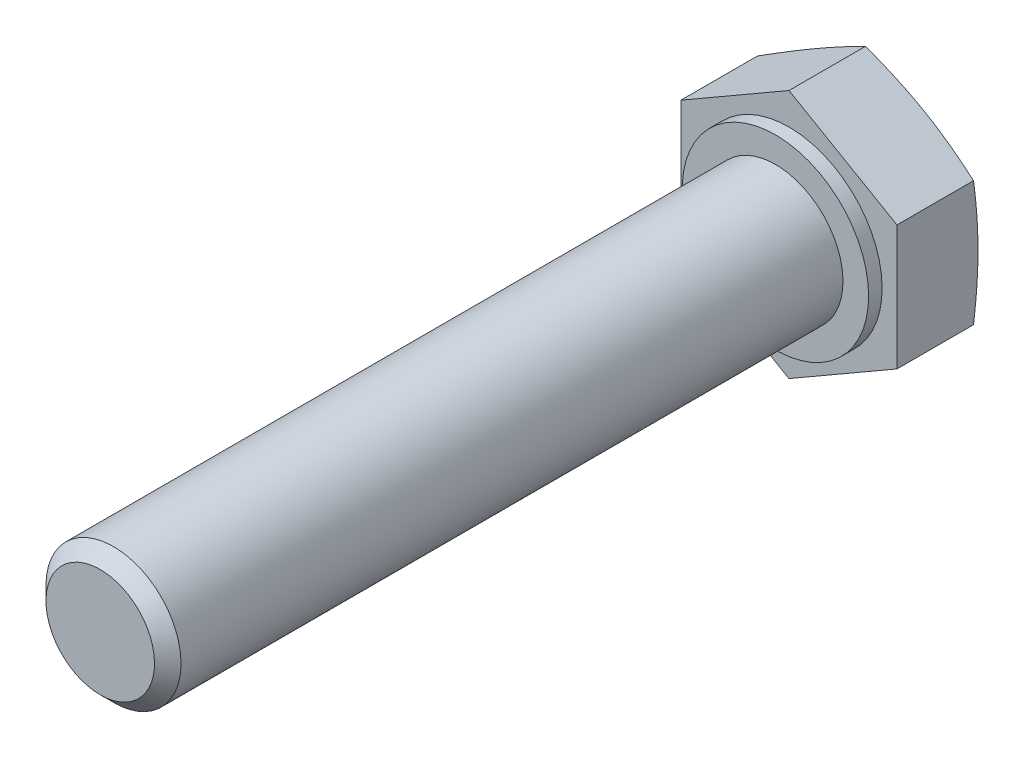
ISO-10303-21;
HEADER;
FILE_DESCRIPTION(('STEP AP214'),'2;1');
FILE_NAME('part.step','',(''),(''),'','','');
FILE_SCHEMA(('AUTOMOTIVE_DESIGN { 1 0 10303 214 1 1 1 1 }'));
ENDSEC;
DATA;
#1=APPLICATION_CONTEXT('core data for automotive mechanical design processes');
#2=APPLICATION_PROTOCOL_DEFINITION('international standard','automotive_design',2000,#1);
#3=PRODUCT_CONTEXT('',#1,'mechanical');
#4=PRODUCT('Part','Part','',(#3));
#5=PRODUCT_RELATED_PRODUCT_CATEGORY('part','',(#4));
#6=PRODUCT_DEFINITION_FORMATION('','',#4);
#7=PRODUCT_DEFINITION_CONTEXT('part definition',#1,'design');
#8=PRODUCT_DEFINITION('design','',#6,#7);
#9=PRODUCT_DEFINITION_SHAPE('','',#8);
#10=(LENGTH_UNIT() NAMED_UNIT(*) SI_UNIT(.MILLI.,.METRE.));
#11=(NAMED_UNIT(*) PLANE_ANGLE_UNIT() SI_UNIT($,.RADIAN.));
#12=(NAMED_UNIT(*) SI_UNIT($,.STERADIAN.) SOLID_ANGLE_UNIT());
#13=UNCERTAINTY_MEASURE_WITH_UNIT(LENGTH_MEASURE(1.E-05),#10,'distance_accuracy_value','');
#14=(GEOMETRIC_REPRESENTATION_CONTEXT(3) GLOBAL_UNCERTAINTY_ASSIGNED_CONTEXT((#13)) GLOBAL_UNIT_ASSIGNED_CONTEXT((#10,
#11,#12)) REPRESENTATION_CONTEXT('',''));
#15=CARTESIAN_POINT('',(0.,0.,0.));
#16=DIRECTION('',(0.,0.,1.));
#17=DIRECTION('',(1.,0.,0.));
#18=AXIS2_PLACEMENT_3D('',#15,#16,#17);
#19=CARTESIAN_POINT('',(6.92820323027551,-4.,3.));
#20=DIRECTION('',(0.,0.,1.));
#21=DIRECTION('',(0.866025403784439,-0.5,0.));
#22=AXIS2_PLACEMENT_3D('',#19,#20,#21);
#23=PLANE('',#22);
#24=CARTESIAN_POINT('',(0.,0.,3.));
#25=DIRECTION('',(0.,0.,-1.));
#26=DIRECTION('',(-0.866025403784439,0.5,0.));
#27=AXIS2_PLACEMENT_3D('',#24,#25,#26);
#28=CIRCLE('',#27,3.45);
#29=CARTESIAN_POINT('',(-2.98778764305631,1.725,3.));
#30=VERTEX_POINT('',#29);
#31=EDGE_CURVE('E159',#30,#30,#28,.T.);
#32=ORIENTED_EDGE('',*,*,#31,.T.);
#33=EDGE_LOOP('',(#32));
#34=FACE_BOUND('',#33,.T.);
#35=DIRECTION('',(-0.866025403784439,0.5,0.));
#36=VECTOR('',#35,1.);
#37=CARTESIAN_POINT('',(8.92820323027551,-0.535898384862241,3.));
#38=LINE('',#37,#36);
#39=CARTESIAN_POINT('',(4.,2.30940107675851,3.));
#40=VERTEX_POINT('',#39);
#41=CARTESIAN_POINT('',(0.,4.61880215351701,3.));
#42=VERTEX_POINT('',#41);
#43=EDGE_CURVE('E161',#40,#42,#38,.T.);
#44=ORIENTED_EDGE('',*,*,#43,.T.);
#45=DIRECTION('',(-0.866025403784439,-0.5,0.));
#46=VECTOR('',#45,1.);
#47=CARTESIAN_POINT('',(1.46410161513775,5.46410161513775,3.));
#48=LINE('',#47,#46);
#49=CARTESIAN_POINT('',(-4.,2.3094010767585,3.));
#50=VERTEX_POINT('',#49);
#51=EDGE_CURVE('E9',#42,#50,#48,.T.);
#52=ORIENTED_EDGE('',*,*,#51,.T.);
#53=DIRECTION('',(0.,-1.,0.));
#54=VECTOR('',#53,1.);
#55=CARTESIAN_POINT('',(-4.,-4.,3.));
#56=LINE('',#55,#54);
#57=CARTESIAN_POINT('',(-4.,-2.30940107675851,3.));
#58=VERTEX_POINT('',#57);
#59=EDGE_CURVE('E22',#50,#58,#56,.T.);
#60=ORIENTED_EDGE('',*,*,#59,.T.);
#61=DIRECTION('',(0.866025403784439,-0.5,0.));
#62=VECTOR('',#61,1.);
#63=CARTESIAN_POINT('',(4.92820323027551,-7.46410161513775,3.));
#64=LINE('',#63,#62);
#65=CARTESIAN_POINT('',(0.,-4.61880215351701,3.));
#66=VERTEX_POINT('',#65);
#67=EDGE_CURVE('E174',#58,#66,#64,.T.);
#68=ORIENTED_EDGE('',*,*,#67,.T.);
#69=DIRECTION('',(0.866025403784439,0.5,0.));
#70=VECTOR('',#69,1.);
#71=CARTESIAN_POINT('',(5.46410161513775,-1.46410161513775,3.));
#72=LINE('',#71,#70);
#73=CARTESIAN_POINT('',(4.,-2.3094010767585,3.));
#74=VERTEX_POINT('',#73);
#75=EDGE_CURVE('E166',#66,#74,#72,.T.);
#76=ORIENTED_EDGE('',*,*,#75,.T.);
#77=DIRECTION('',(0.,1.,0.));
#78=VECTOR('',#77,1.);
#79=CARTESIAN_POINT('',(4.,-4.,3.));
#80=LINE('',#79,#78);
#81=EDGE_CURVE('E164',#74,#40,#80,.T.);
#82=ORIENTED_EDGE('',*,*,#81,.T.);
#83=EDGE_LOOP('',(#44,#52,#60,#68,#76,#82));
#84=FACE_BOUND('',#83,.T.);
#85=ADVANCED_FACE('F14',(#34,#84),#23,.T.);
#86=CARTESIAN_POINT('',(0.,0.,28.5));
#87=DIRECTION('',(0.,0.,-1.));
#88=DIRECTION('',(-0.866025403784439,0.5,0.));
#89=AXIS2_PLACEMENT_3D('',#86,#87,#88);
#90=CYLINDRICAL_SURFACE('',#89,3.45);
#91=CARTESIAN_POINT('',(0.,0.,3.5));
#92=DIRECTION('',(0.,0.,-1.));
#93=DIRECTION('',(-0.866025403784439,0.5,0.));
#94=AXIS2_PLACEMENT_3D('',#91,#92,#93);
#95=CIRCLE('',#94,3.45);
#96=CARTESIAN_POINT('',(-2.98778764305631,1.725,3.5));
#97=VERTEX_POINT('',#96);
#98=EDGE_CURVE('E252',#97,#97,#95,.T.);
#99=ORIENTED_EDGE('',*,*,#98,.T.);
#100=EDGE_LOOP('',(#99));
#101=FACE_BOUND('',#100,.T.);
#102=ORIENTED_EDGE('',*,*,#31,.F.);
#103=EDGE_LOOP('',(#102));
#104=FACE_BOUND('',#103,.T.);
#105=ADVANCED_FACE('F147',(#101,#104),#90,.T.);
#106=CARTESIAN_POINT('',(2.98778764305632,-1.725,3.5));
#107=DIRECTION('',(0.,0.,1.));
#108=DIRECTION('',(0.866025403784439,-0.5,0.));
#109=AXIS2_PLACEMENT_3D('',#106,#107,#108);
#110=PLANE('',#109);
#111=CARTESIAN_POINT('',(0.,0.,3.5));
#112=DIRECTION('',(0.,0.,-1.));
#113=DIRECTION('',(-0.866025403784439,0.5,0.));
#114=AXIS2_PLACEMENT_3D('',#111,#112,#113);
#115=CIRCLE('',#114,2.5);
#116=CARTESIAN_POINT('',(-2.1650635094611,1.25,3.5));
#117=VERTEX_POINT('',#116);
#118=EDGE_CURVE('E254',#117,#117,#115,.T.);
#119=ORIENTED_EDGE('',*,*,#118,.T.);
#120=EDGE_LOOP('',(#119));
#121=FACE_BOUND('',#120,.T.);
#122=ORIENTED_EDGE('',*,*,#98,.F.);
#123=EDGE_LOOP('',(#122));
#124=FACE_BOUND('',#123,.T.);
#125=ADVANCED_FACE('F143',(#121,#124),#110,.T.);
#126=CARTESIAN_POINT('',(0.,0.,28.5));
#127=DIRECTION('',(0.,0.,-1.));
#128=DIRECTION('',(-0.866025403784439,0.5,0.));
#129=AXIS2_PLACEMENT_3D('',#126,#127,#128);
#130=CYLINDRICAL_SURFACE('',#129,2.5);
#131=CARTESIAN_POINT('',(0.,0.,28.0095));
#132=DIRECTION('',(0.,0.,-1.));
#133=DIRECTION('',(-0.866025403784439,0.5,0.));
#134=AXIS2_PLACEMENT_3D('',#131,#132,#133);
#135=CIRCLE('',#134,2.5);
#136=CARTESIAN_POINT('',(-2.1650635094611,1.25,28.0095));
#137=VERTEX_POINT('',#136);
#138=EDGE_CURVE('E258',#137,#137,#135,.T.);
#139=ORIENTED_EDGE('',*,*,#138,.T.);
#140=EDGE_LOOP('',(#139));
#141=FACE_BOUND('',#140,.T.);
#142=ORIENTED_EDGE('',*,*,#118,.F.);
#143=EDGE_LOOP('',(#142));
#144=FACE_BOUND('',#143,.T.);
#145=ADVANCED_FACE('F139',(#141,#144),#130,.T.);
#146=CARTESIAN_POINT('',(0.,0.,28.0095));
#147=DIRECTION('',(0.,0.,-1.));
#148=DIRECTION('',(-0.866025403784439,0.5,0.));
#149=AXIS2_PLACEMENT_3D('',#146,#147,#148);
#150=CONICAL_SURFACE('',#149,2.5,0.785398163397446);
#151=CARTESIAN_POINT('',(0.,0.,28.5));
#152=DIRECTION('',(0.,0.,-1.));
#153=DIRECTION('',(-0.866025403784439,0.5,0.));
#154=AXIS2_PLACEMENT_3D('',#151,#152,#153);
#155=CIRCLE('',#154,2.0095);
#156=CARTESIAN_POINT('',(-1.74027804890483,1.00475,28.5));
#157=VERTEX_POINT('',#156);
#158=EDGE_CURVE('E105',#157,#157,#155,.T.);
#159=ORIENTED_EDGE('',*,*,#158,.T.);
#160=EDGE_LOOP('',(#159));
#161=FACE_BOUND('',#160,.T.);
#162=ORIENTED_EDGE('',*,*,#138,.F.);
#163=EDGE_LOOP('',(#162));
#164=FACE_BOUND('',#163,.T.);
#165=ADVANCED_FACE('F135',(#161,#164),#150,.T.);
#166=CARTESIAN_POINT('',(1.74027804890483,-1.00475,28.5));
#167=DIRECTION('',(0.,0.,1.));
#168=DIRECTION('',(0.866025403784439,-0.5,0.));
#169=AXIS2_PLACEMENT_3D('',#166,#167,#168);
#170=PLANE('',#169);
#171=ORIENTED_EDGE('',*,*,#158,.F.);
#172=EDGE_LOOP('',(#171));
#173=FACE_BOUND('',#172,.T.);
#174=ADVANCED_FACE('F130',(#173),#170,.T.);
#175=CARTESIAN_POINT('',(0.,4.61880215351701,0.));
#176=DIRECTION('',(-0.5,0.866025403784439,0.));
#177=DIRECTION('',(-0.866025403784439,-0.5,0.));
#178=AXIS2_PLACEMENT_3D('',#175,#176,#177);
#179=PLANE('',#178);
#180=DIRECTION('',(0.,0.,1.));
#181=VECTOR('',#180,1.);
#182=CARTESIAN_POINT('',(-4.,2.3094010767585,0.));
#183=LINE('',#182,#181);
#184=CARTESIAN_POINT('',(-4.,2.3094010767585,0.16580753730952));
#185=VERTEX_POINT('',#184);
#186=EDGE_CURVE('E179',#185,#50,#183,.T.);
#187=ORIENTED_EDGE('',*,*,#186,.T.);
#188=ORIENTED_EDGE('',*,*,#51,.F.);
#189=DIRECTION('',(0.,0.,1.));
#190=VECTOR('',#189,1.);
#191=CARTESIAN_POINT('',(0.,4.61880215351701,0.));
#192=LINE('',#191,#190);
#193=CARTESIAN_POINT('',(0.,4.61880215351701,0.16580753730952));
#194=VERTEX_POINT('',#193);
#195=EDGE_CURVE('E35',#194,#42,#192,.T.);
#196=ORIENTED_EDGE('',*,*,#195,.F.);
#197=CARTESIAN_POINT('',(-4.0002,2.30928560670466,0.16583847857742));
#198=CARTESIAN_POINT('',(-3.83407348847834,2.40519879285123,0.140126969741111));
#199=CARTESIAN_POINT('',(-3.66764575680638,2.50128588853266,0.116785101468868));
#200=CARTESIAN_POINT('',(-3.33420250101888,2.69379944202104,0.0757755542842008));
#201=CARTESIAN_POINT('',(-3.16718676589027,2.79022602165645,0.0581101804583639));
#202=CARTESIAN_POINT('',(-2.83358019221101,2.98283386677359,0.0294849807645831));
#203=CARTESIAN_POINT('',(-2.66699160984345,3.07901382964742,0.0184910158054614));
#204=CARTESIAN_POINT('',(-2.3336019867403,3.27149641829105,0.00374922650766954));
#205=CARTESIAN_POINT('',(-2.16680099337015,3.36779901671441,0.));
#206=CARTESIAN_POINT('',(-1.83319900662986,3.56040421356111,0.));
#207=CARTESIAN_POINT('',(-1.66639801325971,3.65670681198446,0.00374922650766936));
#208=CARTESIAN_POINT('',(-1.33300839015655,3.84918940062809,0.0184910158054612));
#209=CARTESIAN_POINT('',(-1.16641980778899,3.94536936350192,0.029484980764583));
#210=CARTESIAN_POINT('',(-0.832813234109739,4.13797720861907,0.0581101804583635));
#211=CARTESIAN_POINT('',(-0.665797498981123,4.23440378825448,0.0757755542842));
#212=CARTESIAN_POINT('',(-0.332354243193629,4.42691734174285,0.116785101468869));
#213=CARTESIAN_POINT('',(-0.165926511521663,4.52300443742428,0.140126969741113));
#214=CARTESIAN_POINT('',(0.000200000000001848,4.61891762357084,0.165838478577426));
#215=B_SPLINE_CURVE_WITH_KNOTS('',3,(#197,#198,#199,#200,#201,#202,#203,#204,#205,#206,#207,
#208,#209,#210,#211,#212,#213,#214),.UNSPECIFIED.,.F.,.F.,(4,2,2,2,2,2,2,2,4),(0.,
0.580655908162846,1.1615473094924,1.73944052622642,2.31722188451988,2.89500324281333,
3.47289645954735,4.05378786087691,4.63444376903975),.UNSPECIFIED.);
#216=CARTESIAN_POINT('',(-2.,3.46410161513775,0.));
#217=VERTEX_POINT('',#216);
#218=EDGE_CURVE('E95',#217,#194,#215,.T.);
#219=ORIENTED_EDGE('',*,*,#218,.F.);
#220=EDGE_CURVE('E102',#185,#217,#215,.T.);
#221=ORIENTED_EDGE('',*,*,#220,.F.);
#222=EDGE_LOOP('',(#187,#188,#196,#219,#221));
#223=FACE_BOUND('',#222,.T.);
#224=ADVANCED_FACE('F94',(#223),#179,.T.);
#225=CARTESIAN_POINT('',(-4.,2.3094010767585,0.));
#226=DIRECTION('',(-1.,0.,0.));
#227=DIRECTION('',(0.,-1.,0.));
#228=AXIS2_PLACEMENT_3D('',#225,#226,#227);
#229=PLANE('',#228);
#230=DIRECTION('',(0.,0.,1.));
#231=VECTOR('',#230,1.);
#232=CARTESIAN_POINT('',(-4.,-2.30940107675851,0.));
#233=LINE('',#232,#231);
#234=CARTESIAN_POINT('',(-4.,-2.30940107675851,0.165807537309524));
#235=VERTEX_POINT('',#234);
#236=EDGE_CURVE('E182',#235,#58,#233,.T.);
#237=ORIENTED_EDGE('',*,*,#236,.T.);
#238=ORIENTED_EDGE('',*,*,#59,.F.);
#239=ORIENTED_EDGE('',*,*,#186,.F.);
#240=CARTESIAN_POINT('',(-4.,-2.30963201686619,0.165838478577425));
#241=CARTESIAN_POINT('',(-4.,-2.11780564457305,0.140126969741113));
#242=CARTESIAN_POINT('',(-4.,-1.9256314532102,0.116785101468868));
#243=CARTESIAN_POINT('',(-4.,-1.54060434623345,0.0757755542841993));
#244=CARTESIAN_POINT('',(-4.,-1.34775118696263,0.0581101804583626));
#245=CARTESIAN_POINT('',(-4.,-0.962535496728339,0.0294849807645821));
#246=CARTESIAN_POINT('',(-4.,-0.770175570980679,0.0184910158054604));
#247=CARTESIAN_POINT('',(-4.,-0.38521039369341,0.00374922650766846));
#248=CARTESIAN_POINT('',(-4.,-0.192605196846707,0.));
#249=CARTESIAN_POINT('',(-4.,0.192605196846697,0.));
#250=CARTESIAN_POINT('',(-4.,0.385210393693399,0.0037492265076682));
#251=CARTESIAN_POINT('',(-4.,0.770175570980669,0.0184910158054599));
#252=CARTESIAN_POINT('',(-4.,0.962535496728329,0.0294849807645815));
#253=CARTESIAN_POINT('',(-4.,1.34775118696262,0.0581101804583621));
#254=CARTESIAN_POINT('',(-4.,1.54060434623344,0.075775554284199));
#255=CARTESIAN_POINT('',(-4.,1.92563145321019,0.116785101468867));
#256=CARTESIAN_POINT('',(-4.,2.11780564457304,0.14012696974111));
#257=CARTESIAN_POINT('',(-4.,2.30963201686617,0.16583847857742));
#258=B_SPLINE_CURVE_WITH_KNOTS('',3,(#240,#241,#242,#243,#244,#245,#246,#247,#248,#249,#250,
#251,#252,#253,#254,#255,#256,#257),.UNSPECIFIED.,.F.,.F.,(4,2,2,2,2,2,2,2,4),(0.,
0.580655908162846,1.1615473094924,1.73944052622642,2.31722188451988,2.89500324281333,
3.47289645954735,4.05378786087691,4.63444376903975),.UNSPECIFIED.);
#259=CARTESIAN_POINT('',(-4.,0.,0.));
#260=VERTEX_POINT('',#259);
#261=EDGE_CURVE('E107',#260,#185,#258,.T.);
#262=ORIENTED_EDGE('',*,*,#261,.F.);
#263=EDGE_CURVE('E103',#235,#260,#258,.T.);
#264=ORIENTED_EDGE('',*,*,#263,.F.);
#265=EDGE_LOOP('',(#237,#238,#239,#262,#264));
#266=FACE_BOUND('',#265,.T.);
#267=ADVANCED_FACE('F129',(#266),#229,.T.);
#268=CARTESIAN_POINT('',(-4.,-2.30940107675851,0.));
#269=DIRECTION('',(-0.5,-0.866025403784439,0.));
#270=DIRECTION('',(0.866025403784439,-0.5,0.));
#271=AXIS2_PLACEMENT_3D('',#268,#269,#270);
#272=PLANE('',#271);
#273=DIRECTION('',(0.,0.,1.));
#274=VECTOR('',#273,1.);
#275=CARTESIAN_POINT('',(0.,-4.61880215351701,0.));
#276=LINE('',#275,#274);
#277=CARTESIAN_POINT('',(0.,-4.61880215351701,0.165807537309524));
#278=VERTEX_POINT('',#277);
#279=EDGE_CURVE('E184',#278,#66,#276,.T.);
#280=ORIENTED_EDGE('',*,*,#279,.T.);
#281=ORIENTED_EDGE('',*,*,#67,.F.);
#282=ORIENTED_EDGE('',*,*,#236,.F.);
#283=CARTESIAN_POINT('',(-7.34441323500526,-0.378503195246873,0.89874448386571));
#284=CARTESIAN_POINT('',(-7.18662398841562,-0.469602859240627,0.857788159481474));
#285=CARTESIAN_POINT('',(-7.02873757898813,-0.560758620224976,0.8173225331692));
#286=CARTESIAN_POINT('',(-6.71272243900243,-0.743210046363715,0.737637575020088));
#287=CARTESIAN_POINT('',(-6.55459369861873,-0.834505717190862,0.698418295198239));
#288=CARTESIAN_POINT('',(-6.23791240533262,-1.01734174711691,0.621458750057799));
#289=CARTESIAN_POINT('',(-6.07935959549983,-1.10888225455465,0.583719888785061));
#290=CARTESIAN_POINT('',(-5.7619283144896,-1.29215129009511,0.510118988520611));
#291=CARTESIAN_POINT('',(-5.60304984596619,-1.38387981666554,0.474256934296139));
#292=CARTESIAN_POINT('',(-5.28619796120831,-1.56681433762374,0.405137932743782));
#293=CARTESIAN_POINT('',(-5.12822764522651,-1.6580185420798,0.371862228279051));
#294=CARTESIAN_POINT('',(-4.81185902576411,-1.84067404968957,0.308151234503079));
#295=CARTESIAN_POINT('',(-4.65346071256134,-1.93212535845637,0.27771601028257));
#296=CARTESIAN_POINT('',(-4.17756469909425,-2.20688404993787,0.191656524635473));
#297=CARTESIAN_POINT('',(-3.85930938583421,-2.39062884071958,0.141265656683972));
#298=CARTESIAN_POINT('',(-3.37862783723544,-2.66815046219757,0.0808604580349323));
#299=CARTESIAN_POINT('',(-3.21692072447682,-2.76151210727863,0.0631992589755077));
#300=CARTESIAN_POINT('',(-2.8930859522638,-2.94847820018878,0.0340086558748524));
#301=CARTESIAN_POINT('',(-2.73095830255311,-3.04208264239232,0.0224791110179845));
#302=CARTESIAN_POINT('',(-2.40652343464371,-3.22939520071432,0.00621961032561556));
#303=CARTESIAN_POINT('',(-2.24421634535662,-3.32310324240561,0.00148628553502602));
#304=CARTESIAN_POINT('',(-1.91956264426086,-3.51054214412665,-0.000887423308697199));
#305=CARTESIAN_POINT('',(-1.75721603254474,-3.60427300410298,0.00147217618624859));
#306=CARTESIAN_POINT('',(-1.43209374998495,-3.79198244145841,0.0131530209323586));
#307=CARTESIAN_POINT('',(-1.26931880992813,-3.88596059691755,0.022500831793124));
#308=CARTESIAN_POINT('',(-0.944144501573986,-4.07370007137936,0.0476203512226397));
#309=CARTESIAN_POINT('',(-0.781745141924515,-4.16746138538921,0.0633922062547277));
#310=CARTESIAN_POINT('',(-0.457323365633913,-4.35476638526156,0.100547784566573));
#311=CARTESIAN_POINT('',(-0.295301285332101,-4.44830987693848,0.121935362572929));
#312=CARTESIAN_POINT('',(0.028219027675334,-4.63509441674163,0.169413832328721));
#313=CARTESIAN_POINT('',(0.189717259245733,-4.72833546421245,0.19550473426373));
#314=CARTESIAN_POINT('',(0.511316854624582,-4.91401107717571,0.251380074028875));
#315=CARTESIAN_POINT('',(0.671421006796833,-5.00644725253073,0.281143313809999));
#316=CARTESIAN_POINT('',(0.991178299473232,-5.19105921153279,0.343755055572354));
#317=CARTESIAN_POINT('',(1.15083142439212,-5.28323498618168,0.376603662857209));
#318=CARTESIAN_POINT('',(1.62923051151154,-5.55943882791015,0.478849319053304));
#319=CARTESIAN_POINT('',(1.94738263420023,-5.74312404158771,0.551940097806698));
#320=CARTESIAN_POINT('',(2.58262267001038,-6.10988004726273,0.704515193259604));
#321=CARTESIAN_POINT('',(2.89971019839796,-6.29295061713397,0.784001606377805));
#322=CARTESIAN_POINT('',(3.53303313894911,-6.65859978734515,0.947239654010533));
#323=CARTESIAN_POINT('',(3.84926861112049,-6.8411784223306,1.03099097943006));
#324=CARTESIAN_POINT('',(4.47775883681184,-7.20403742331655,1.20052176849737));
#325=CARTESIAN_POINT('',(4.79001995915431,-7.38432146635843,1.28626991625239));
#326=CARTESIAN_POINT('',(5.41411931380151,-7.74464539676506,1.4598245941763));
#327=CARTESIAN_POINT('',(5.72595753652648,-7.92468527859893,1.54763117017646));
#328=CARTESIAN_POINT('',(6.34887160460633,-8.28432488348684,1.72462114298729));
#329=CARTESIAN_POINT('',(6.65994790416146,-8.46392486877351,1.81380241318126));
#330=CARTESIAN_POINT('',(7.28184055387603,-8.82297475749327,1.99331080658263));
#331=CARTESIAN_POINT('',(7.59265691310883,-9.00242466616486,2.08363788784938));
#332=CARTESIAN_POINT('',(7.9033846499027,-9.18182340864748,2.17436506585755));
#333=B_SPLINE_CURVE_WITH_KNOTS('',3,(#283,#284,#285,#286,#287,#288,#289,#290,#291,#292,#293,
#294,#295,#296,#297,#298,#299,#300,#301,#302,#303,#304,#305,#306,#307,#308,#309,#310,#311,#312,
#313,#314,#315,#316,#317,#318,#319,#320,#321,#322,#323,#324,#325,#326,#327,#328,#329,#330,#331,
#332),.UNSPECIFIED.,.F.,.F.,(4,2,2,2,2,2,2,2,2,2,2,2,2,2,2,2,2,2,2,2,2,2,2,2,4),(0.,
0.560239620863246,1.12050259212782,1.68128467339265,2.24206220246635,2.79829502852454,
3.35454059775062,4.46683223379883,5.02942093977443,5.59199672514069,6.15429353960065,
6.71658904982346,7.28103305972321,7.84548993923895,8.41033528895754,8.97518186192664,
9.53690839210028,10.0986541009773,11.2222631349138,12.3462419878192,13.4701394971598,
14.5820036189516,15.69389252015,16.804206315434,17.9144795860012),.UNSPECIFIED.);
#334=CARTESIAN_POINT('',(-2.,-3.46410161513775,0.));
#335=VERTEX_POINT('',#334);
#336=EDGE_CURVE('E220',#335,#235,#333,.F.);
#337=ORIENTED_EDGE('',*,*,#336,.F.);
#338=EDGE_CURVE('E226',#278,#335,#333,.F.);
#339=ORIENTED_EDGE('',*,*,#338,.F.);
#340=EDGE_LOOP('',(#280,#281,#282,#337,#339));
#341=FACE_BOUND('',#340,.T.);
#342=ADVANCED_FACE('F214',(#341),#272,.T.);
#343=CARTESIAN_POINT('',(0.,-4.61880215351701,0.));
#344=DIRECTION('',(0.5,-0.866025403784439,0.));
#345=DIRECTION('',(0.866025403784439,0.5,0.));
#346=AXIS2_PLACEMENT_3D('',#343,#344,#345);
#347=PLANE('',#346);
#348=DIRECTION('',(0.,0.,1.));
#349=VECTOR('',#348,1.);
#350=CARTESIAN_POINT('',(4.,-2.3094010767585,0.));
#351=LINE('',#350,#349);
#352=CARTESIAN_POINT('',(4.,-2.3094010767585,0.16580753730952));
#353=VERTEX_POINT('',#352);
#354=EDGE_CURVE('E272',#353,#74,#351,.T.);
#355=ORIENTED_EDGE('',*,*,#354,.T.);
#356=ORIENTED_EDGE('',*,*,#75,.F.);
#357=ORIENTED_EDGE('',*,*,#279,.F.);
#358=CARTESIAN_POINT('',(4.0002,-2.30928560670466,0.16583847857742));
#359=CARTESIAN_POINT('',(3.83407348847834,-2.40519879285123,0.140126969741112));
#360=CARTESIAN_POINT('',(3.66764575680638,-2.50128588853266,0.116785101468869));
#361=CARTESIAN_POINT('',(3.33420250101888,-2.69379944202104,0.0757755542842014));
#362=CARTESIAN_POINT('',(3.16718676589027,-2.79022602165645,0.0581101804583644));
#363=CARTESIAN_POINT('',(2.83358019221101,-2.98283386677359,0.0294849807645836));
#364=CARTESIAN_POINT('',(2.66699160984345,-3.07901382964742,0.0184910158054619));
#365=CARTESIAN_POINT('',(2.3336019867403,-3.27149641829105,0.00374922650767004));
#366=CARTESIAN_POINT('',(2.16680099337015,-3.3677990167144,0.));
#367=CARTESIAN_POINT('',(1.83319900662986,-3.56040421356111,0.));
#368=CARTESIAN_POINT('',(1.66639801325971,-3.65670681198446,0.00374922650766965));
#369=CARTESIAN_POINT('',(1.33300839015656,-3.84918940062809,0.0184910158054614));
#370=CARTESIAN_POINT('',(1.16641980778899,-3.94536936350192,0.0294849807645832));
#371=CARTESIAN_POINT('',(0.832813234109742,-4.13797720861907,0.0581101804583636));
#372=CARTESIAN_POINT('',(0.665797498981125,-4.23440378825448,0.0757755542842));
#373=CARTESIAN_POINT('',(0.332354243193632,-4.42691734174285,0.116785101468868));
#374=CARTESIAN_POINT('',(0.165926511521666,-4.52300443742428,0.140126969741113));
#375=CARTESIAN_POINT('',(-0.000199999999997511,-4.61891762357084,0.165838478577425));
#376=B_SPLINE_CURVE_WITH_KNOTS('',3,(#358,#359,#360,#361,#362,#363,#364,#365,#366,#367,#368,
#369,#370,#371,#372,#373,#374,#375),.UNSPECIFIED.,.F.,.F.,(4,2,2,2,2,2,2,2,4),(0.,
0.580655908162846,1.1615473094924,1.73944052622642,2.31722188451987,2.89500324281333,
3.47289645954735,4.0537878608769,4.63444376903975),.UNSPECIFIED.);
#377=CARTESIAN_POINT('',(2.,-3.46410161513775,0.));
#378=VERTEX_POINT('',#377);
#379=EDGE_CURVE('E200',#378,#278,#376,.T.);
#380=ORIENTED_EDGE('',*,*,#379,.F.);
#381=EDGE_CURVE('E227',#353,#378,#376,.T.);
#382=ORIENTED_EDGE('',*,*,#381,.F.);
#383=EDGE_LOOP('',(#355,#356,#357,#380,#382));
#384=FACE_BOUND('',#383,.T.);
#385=ADVANCED_FACE('F209',(#384),#347,.T.);
#386=CARTESIAN_POINT('',(4.,-2.3094010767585,0.));
#387=DIRECTION('',(1.,0.,0.));
#388=DIRECTION('',(0.,1.,0.));
#389=AXIS2_PLACEMENT_3D('',#386,#387,#388);
#390=PLANE('',#389);
#391=DIRECTION('',(0.,0.,1.));
#392=VECTOR('',#391,1.);
#393=CARTESIAN_POINT('',(4.,2.30940107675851,0.));
#394=LINE('',#393,#392);
#395=CARTESIAN_POINT('',(4.,2.30940107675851,0.16580753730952));
#396=VERTEX_POINT('',#395);
#397=EDGE_CURVE('E29',#396,#40,#394,.T.);
#398=ORIENTED_EDGE('',*,*,#397,.T.);
#399=ORIENTED_EDGE('',*,*,#81,.F.);
#400=ORIENTED_EDGE('',*,*,#354,.F.);
#401=CARTESIAN_POINT('',(4.,2.30963201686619,0.165838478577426));
#402=CARTESIAN_POINT('',(4.,2.11780564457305,0.140126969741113));
#403=CARTESIAN_POINT('',(4.,1.9256314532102,0.116785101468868));
#404=CARTESIAN_POINT('',(4.,1.54060434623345,0.0757755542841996));
#405=CARTESIAN_POINT('',(4.,1.34775118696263,0.058110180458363));
#406=CARTESIAN_POINT('',(4.,0.962535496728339,0.0294849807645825));
#407=CARTESIAN_POINT('',(4.,0.770175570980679,0.0184910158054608));
#408=CARTESIAN_POINT('',(4.,0.38521039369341,0.00374922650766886));
#409=CARTESIAN_POINT('',(4.,0.192605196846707,0.));
#410=CARTESIAN_POINT('',(4.,-0.192605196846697,0.));
#411=CARTESIAN_POINT('',(4.,-0.385210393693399,0.00374922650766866));
#412=CARTESIAN_POINT('',(4.,-0.770175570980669,0.0184910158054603));
#413=CARTESIAN_POINT('',(4.,-0.962535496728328,0.0294849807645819));
#414=CARTESIAN_POINT('',(4.,-1.34775118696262,0.0581101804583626));
#415=CARTESIAN_POINT('',(4.,-1.54060434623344,0.0757755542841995));
#416=CARTESIAN_POINT('',(4.,-1.92563145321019,0.116785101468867));
#417=CARTESIAN_POINT('',(4.,-2.11780564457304,0.140126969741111));
#418=CARTESIAN_POINT('',(4.,-2.30963201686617,0.16583847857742));
#419=B_SPLINE_CURVE_WITH_KNOTS('',3,(#401,#402,#403,#404,#405,#406,#407,#408,#409,#410,#411,
#412,#413,#414,#415,#416,#417,#418),.UNSPECIFIED.,.F.,.F.,(4,2,2,2,2,2,2,2,4),(0.,
0.580655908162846,1.1615473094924,1.73944052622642,2.31722188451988,2.89500324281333,
3.47289645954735,4.05378786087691,4.63444376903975),.UNSPECIFIED.);
#420=CARTESIAN_POINT('',(4.,0.,0.));
#421=VERTEX_POINT('',#420);
#422=EDGE_CURVE('E90',#421,#353,#419,.T.);
#423=ORIENTED_EDGE('',*,*,#422,.F.);
#424=EDGE_CURVE('E199',#396,#421,#419,.T.);
#425=ORIENTED_EDGE('',*,*,#424,.F.);
#426=EDGE_LOOP('',(#398,#399,#400,#423,#425));
#427=FACE_BOUND('',#426,.T.);
#428=ADVANCED_FACE('F206',(#427),#390,.T.);
#429=CARTESIAN_POINT('',(4.,2.30940107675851,0.));
#430=DIRECTION('',(0.5,0.866025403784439,0.));
#431=DIRECTION('',(-0.866025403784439,0.5,0.));
#432=AXIS2_PLACEMENT_3D('',#429,#430,#431);
#433=PLANE('',#432);
#434=ORIENTED_EDGE('',*,*,#195,.T.);
#435=ORIENTED_EDGE('',*,*,#43,.F.);
#436=ORIENTED_EDGE('',*,*,#397,.F.);
#437=CARTESIAN_POINT('',(-3.34441323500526,6.54970003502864,0.898744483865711));
#438=CARTESIAN_POINT('',(-3.18662398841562,6.45860037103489,0.857788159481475));
#439=CARTESIAN_POINT('',(-3.02873757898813,6.36744461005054,0.817322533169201));
#440=CARTESIAN_POINT('',(-2.71272243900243,6.1849931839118,0.737637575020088));
#441=CARTESIAN_POINT('',(-2.55459369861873,6.09369751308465,0.69841829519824));
#442=CARTESIAN_POINT('',(-2.23791240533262,5.9108614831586,0.621458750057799));
#443=CARTESIAN_POINT('',(-2.07935959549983,5.81932097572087,0.583719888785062));
#444=CARTESIAN_POINT('',(-1.7619283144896,5.6360519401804,0.510118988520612));
#445=CARTESIAN_POINT('',(-1.60304984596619,5.54432341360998,0.474256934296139));
#446=CARTESIAN_POINT('',(-1.28619796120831,5.36138889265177,0.405137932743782));
#447=CARTESIAN_POINT('',(-1.12822764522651,5.27018468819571,0.371862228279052));
#448=CARTESIAN_POINT('',(-0.811859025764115,5.08752918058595,0.30815123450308));
#449=CARTESIAN_POINT('',(-0.65346071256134,4.99607787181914,0.27771601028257));
#450=CARTESIAN_POINT('',(-0.177564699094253,4.72131918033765,0.191656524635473));
#451=CARTESIAN_POINT('',(0.140690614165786,4.53757438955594,0.141265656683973));
#452=CARTESIAN_POINT('',(0.621372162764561,4.26005276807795,0.0808604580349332));
#453=CARTESIAN_POINT('',(0.78307927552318,4.16669112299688,0.063199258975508));
#454=CARTESIAN_POINT('',(1.1069140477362,3.97972503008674,0.0340086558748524));
#455=CARTESIAN_POINT('',(1.26904169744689,3.88612058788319,0.0224791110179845));
#456=CARTESIAN_POINT('',(1.59347656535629,3.6988080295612,0.00621961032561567));
#457=CARTESIAN_POINT('',(1.75578365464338,3.60509998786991,0.00148628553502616));
#458=CARTESIAN_POINT('',(2.08043735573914,3.41766108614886,-0.000887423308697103));
#459=CARTESIAN_POINT('',(2.24278396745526,3.32393022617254,0.00147217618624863));
#460=CARTESIAN_POINT('',(2.56790625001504,3.1362207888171,0.0131530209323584));
#461=CARTESIAN_POINT('',(2.73068119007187,3.04224263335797,0.0225008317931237));
#462=CARTESIAN_POINT('',(3.05585549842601,2.85450315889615,0.0476203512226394));
#463=CARTESIAN_POINT('',(3.21825485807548,2.76074184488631,0.0633922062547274));
#464=CARTESIAN_POINT('',(3.54267663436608,2.57343684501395,0.100547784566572));
#465=CARTESIAN_POINT('',(3.70469871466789,2.47989335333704,0.121935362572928));
#466=CARTESIAN_POINT('',(4.02821902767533,2.29310881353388,0.16941383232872));
#467=CARTESIAN_POINT('',(4.18971725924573,2.19986776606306,0.195504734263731));
#468=CARTESIAN_POINT('',(4.51131685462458,2.01419215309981,0.251380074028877));
#469=CARTESIAN_POINT('',(4.67142100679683,1.92175597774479,0.281143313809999));
#470=CARTESIAN_POINT('',(4.99117829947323,1.73714401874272,0.343755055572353));
#471=CARTESIAN_POINT('',(5.15083142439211,1.64496824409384,0.376603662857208));
#472=CARTESIAN_POINT('',(5.62923051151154,1.36876440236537,0.478849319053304));
#473=CARTESIAN_POINT('',(5.94738263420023,1.1850791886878,0.551940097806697));
#474=CARTESIAN_POINT('',(6.58262267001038,0.818323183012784,0.704515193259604));
#475=CARTESIAN_POINT('',(6.89971019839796,0.635252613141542,0.784001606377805));
#476=CARTESIAN_POINT('',(7.53303313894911,0.269603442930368,0.947239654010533));
#477=CARTESIAN_POINT('',(7.84926861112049,0.0870248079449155,1.03099097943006));
#478=CARTESIAN_POINT('',(8.47775883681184,-0.275834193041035,1.20052176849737));
#479=CARTESIAN_POINT('',(8.79001995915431,-0.456118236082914,1.28626991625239));
#480=CARTESIAN_POINT('',(9.41411931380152,-0.816442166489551,1.4598245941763));
#481=CARTESIAN_POINT('',(9.72595753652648,-0.996482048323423,1.54763117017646));
#482=CARTESIAN_POINT('',(10.3488716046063,-1.35612165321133,1.72462114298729));
#483=CARTESIAN_POINT('',(10.6599479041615,-1.535721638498,1.81380241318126));
#484=CARTESIAN_POINT('',(11.281840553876,-1.89477152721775,1.99331080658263));
#485=CARTESIAN_POINT('',(11.5926569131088,-2.07422143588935,2.08363788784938));
#486=CARTESIAN_POINT('',(11.9033846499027,-2.25362017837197,2.17436506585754));
#487=B_SPLINE_CURVE_WITH_KNOTS('',3,(#437,#438,#439,#440,#441,#442,#443,#444,#445,#446,#447,
#448,#449,#450,#451,#452,#453,#454,#455,#456,#457,#458,#459,#460,#461,#462,#463,#464,#465,#466,
#467,#468,#469,#470,#471,#472,#473,#474,#475,#476,#477,#478,#479,#480,#481,#482,#483,#484,#485,
#486),.UNSPECIFIED.,.F.,.F.,(4,2,2,2,2,2,2,2,2,2,2,2,2,2,2,2,2,2,2,2,2,2,2,2,4),(0.,
0.560239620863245,1.12050259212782,1.68128467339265,2.24206220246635,2.79829502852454,
3.35454059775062,4.46683223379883,5.02942093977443,5.59199672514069,6.15429353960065,
6.71658904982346,7.28103305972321,7.84548993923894,8.41033528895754,8.97518186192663,
9.53690839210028,10.0986541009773,11.2222631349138,12.3462419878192,13.4701394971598,
14.5820036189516,15.69389252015,16.804206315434,17.9144795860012),.UNSPECIFIED.);
#488=CARTESIAN_POINT('',(2.,3.46410161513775,0.));
#489=VERTEX_POINT('',#488);
#490=EDGE_CURVE('E85',#489,#396,#487,.T.);
#491=ORIENTED_EDGE('',*,*,#490,.F.);
#492=EDGE_CURVE('E82',#194,#489,#487,.T.);
#493=ORIENTED_EDGE('',*,*,#492,.F.);
#494=EDGE_LOOP('',(#434,#435,#436,#491,#493));
#495=FACE_BOUND('',#494,.T.);
#496=ADVANCED_FACE('F83',(#495),#433,.T.);
#497=CARTESIAN_POINT('',(0.,0.,0.));
#498=DIRECTION('',(0.,0.,1.));
#499=DIRECTION('',(0.866025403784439,-0.5,0.));
#500=AXIS2_PLACEMENT_3D('',#497,#498,#499);
#501=CONICAL_SURFACE('',#500,4.,1.30899693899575);
#502=CARTESIAN_POINT('',(0.,0.,0.));
#503=DIRECTION('',(0.,0.,-1.));
#504=DIRECTION('',(-0.866025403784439,0.5,0.));
#505=AXIS2_PLACEMENT_3D('',#502,#503,#504);
#506=CIRCLE('',#505,4.);
#507=EDGE_CURVE('E170',#260,#217,#506,.T.);
#508=ORIENTED_EDGE('',*,*,#507,.F.);
#509=ORIENTED_EDGE('',*,*,#261,.T.);
#510=ORIENTED_EDGE('',*,*,#220,.T.);
#511=EDGE_LOOP('',(#508,#509,#510));
#512=FACE_BOUND('',#511,.T.);
#513=ADVANCED_FACE('F276',(#512),#501,.T.);
#514=EDGE_CURVE('E250',#335,#260,#506,.T.);
#515=ORIENTED_EDGE('',*,*,#514,.F.);
#516=ORIENTED_EDGE('',*,*,#336,.T.);
#517=ORIENTED_EDGE('',*,*,#263,.T.);
#518=EDGE_LOOP('',(#515,#516,#517));
#519=FACE_BOUND('',#518,.T.);
#520=ADVANCED_FACE('F271',(#519),#501,.T.);
#521=ORIENTED_EDGE('',*,*,#379,.T.);
#522=ORIENTED_EDGE('',*,*,#338,.T.);
#523=EDGE_CURVE('E246',#378,#335,#506,.T.);
#524=ORIENTED_EDGE('',*,*,#523,.F.);
#525=EDGE_LOOP('',(#521,#522,#524));
#526=FACE_BOUND('',#525,.T.);
#527=ADVANCED_FACE('F122',(#526),#501,.T.);
#528=ORIENTED_EDGE('',*,*,#422,.T.);
#529=ORIENTED_EDGE('',*,*,#381,.T.);
#530=EDGE_CURVE('E242',#421,#378,#506,.T.);
#531=ORIENTED_EDGE('',*,*,#530,.F.);
#532=EDGE_LOOP('',(#528,#529,#531));
#533=FACE_BOUND('',#532,.T.);
#534=ADVANCED_FACE('F243',(#533),#501,.T.);
#535=EDGE_CURVE('E101',#217,#489,#506,.T.);
#536=ORIENTED_EDGE('',*,*,#535,.F.);
#537=ORIENTED_EDGE('',*,*,#218,.T.);
#538=ORIENTED_EDGE('',*,*,#492,.T.);
#539=EDGE_LOOP('',(#536,#537,#538));
#540=FACE_BOUND('',#539,.T.);
#541=ADVANCED_FACE('F99',(#540),#501,.T.);
#542=CARTESIAN_POINT('',(0.,0.,0.));
#543=DIRECTION('',(0.,0.,-1.));
#544=DIRECTION('',(-0.866025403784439,0.5,0.));
#545=AXIS2_PLACEMENT_3D('',#542,#543,#544);
#546=PLANE('',#545);
#547=ORIENTED_EDGE('',*,*,#535,.T.);
#548=EDGE_CURVE('E168',#489,#421,#506,.T.);
#549=ORIENTED_EDGE('',*,*,#548,.T.);
#550=ORIENTED_EDGE('',*,*,#530,.T.);
#551=ORIENTED_EDGE('',*,*,#523,.T.);
#552=ORIENTED_EDGE('',*,*,#514,.T.);
#553=ORIENTED_EDGE('',*,*,#507,.T.);
#554=EDGE_LOOP('',(#547,#549,#550,#551,#552,#553));
#555=FACE_BOUND('',#554,.T.);
#556=ADVANCED_FACE('F16',(#555),#546,.T.);
#557=ORIENTED_EDGE('',*,*,#490,.T.);
#558=ORIENTED_EDGE('',*,*,#424,.T.);
#559=ORIENTED_EDGE('',*,*,#548,.F.);
#560=EDGE_LOOP('',(#557,#558,#559));
#561=FACE_BOUND('',#560,.T.);
#562=ADVANCED_FACE('F239',(#561),#501,.T.);
#563=CLOSED_SHELL('',(#85,#105,#125,#145,#165,#174,#224,#267,#342,#385,#428,#496,#513,#520,#527,
#534,#541,#556,#562));
#564=MANIFOLD_SOLID_BREP('B1',#563);
#565=ADVANCED_BREP_SHAPE_REPRESENTATION('',(#18,#564),#14);
#566=SHAPE_DEFINITION_REPRESENTATION(#9,#565);
ENDSEC;
END-ISO-10303-21;
